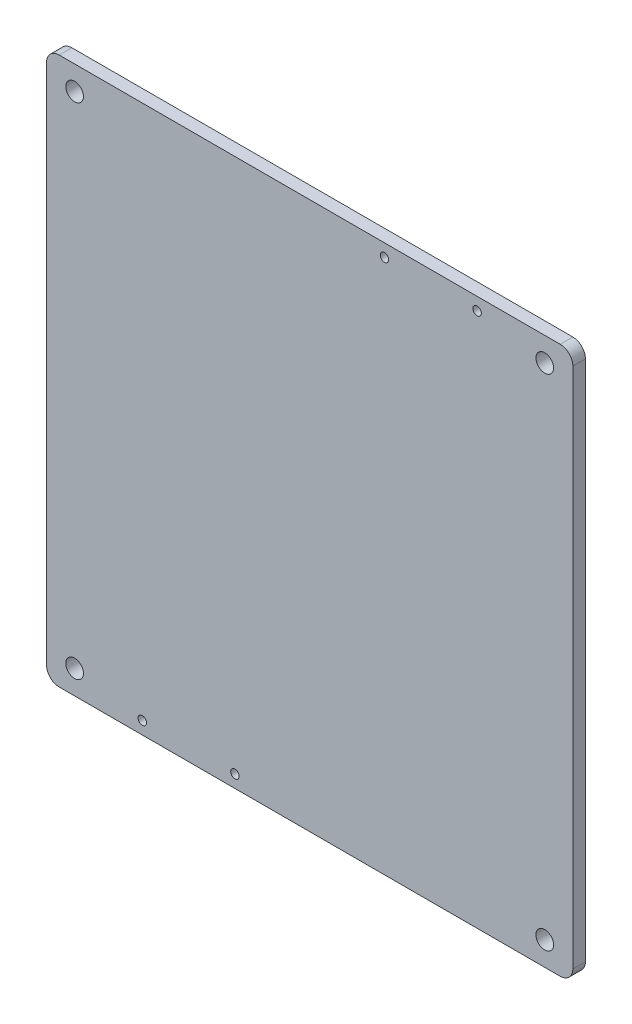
ISO-10303-21;
HEADER;
FILE_DESCRIPTION(('STEP AP214'),'2;1');
FILE_NAME('part.step','',(''),(''),'','','');
FILE_SCHEMA(('AUTOMOTIVE_DESIGN { 1 0 10303 214 1 1 1 1 }'));
ENDSEC;
DATA;
#1=APPLICATION_CONTEXT('core data for automotive mechanical design processes');
#2=APPLICATION_PROTOCOL_DEFINITION('international standard','automotive_design',2000,#1);
#3=PRODUCT_CONTEXT('',#1,'mechanical');
#4=PRODUCT('Part','Part','',(#3));
#5=PRODUCT_RELATED_PRODUCT_CATEGORY('part','',(#4));
#6=PRODUCT_DEFINITION_FORMATION('','',#4);
#7=PRODUCT_DEFINITION_CONTEXT('part definition',#1,'design');
#8=PRODUCT_DEFINITION('design','',#6,#7);
#9=PRODUCT_DEFINITION_SHAPE('','',#8);
#10=(LENGTH_UNIT() NAMED_UNIT(*) SI_UNIT(.MILLI.,.METRE.));
#11=(NAMED_UNIT(*) PLANE_ANGLE_UNIT() SI_UNIT($,.RADIAN.));
#12=(NAMED_UNIT(*) SI_UNIT($,.STERADIAN.) SOLID_ANGLE_UNIT());
#13=UNCERTAINTY_MEASURE_WITH_UNIT(LENGTH_MEASURE(1.E-05),#10,'distance_accuracy_value','');
#14=(GEOMETRIC_REPRESENTATION_CONTEXT(3) GLOBAL_UNCERTAINTY_ASSIGNED_CONTEXT((#13)) GLOBAL_UNIT_ASSIGNED_CONTEXT((#10,
#11,#12)) REPRESENTATION_CONTEXT('',''));
#15=CARTESIAN_POINT('',(0.,0.,0.));
#16=DIRECTION('',(0.,0.,1.));
#17=DIRECTION('',(1.,0.,0.));
#18=AXIS2_PLACEMENT_3D('',#15,#16,#17);
#19=CARTESIAN_POINT('',(62.5,-65.,3.));
#20=DIRECTION('',(-1.,0.,0.));
#21=DIRECTION('',(0.,0.,1.));
#22=AXIS2_PLACEMENT_3D('',#19,#20,#21);
#23=PLANE('',#22);
#24=DIRECTION('',(0.,1.,0.));
#25=VECTOR('',#24,1.);
#26=CARTESIAN_POINT('',(62.5,-65.,3.));
#27=LINE('',#26,#25);
#28=CARTESIAN_POINT('',(62.5,-62.,3.));
#29=VERTEX_POINT('',#28);
#30=CARTESIAN_POINT('',(62.5,62.,3.));
#31=VERTEX_POINT('',#30);
#32=EDGE_CURVE('E122',#29,#31,#27,.T.);
#33=ORIENTED_EDGE('',*,*,#32,.F.);
#34=DIRECTION('',(0.,0.,-1.));
#35=VECTOR('',#34,1.);
#36=CARTESIAN_POINT('',(62.5,-62.,3.));
#37=LINE('',#36,#35);
#38=CARTESIAN_POINT('',(62.5,-62.,0.));
#39=VERTEX_POINT('',#38);
#40=EDGE_CURVE('E107',#29,#39,#37,.T.);
#41=ORIENTED_EDGE('',*,*,#40,.T.);
#42=DIRECTION('',(0.,1.,0.));
#43=VECTOR('',#42,1.);
#44=CARTESIAN_POINT('',(62.5,-65.,0.));
#45=LINE('',#44,#43);
#46=CARTESIAN_POINT('',(62.5,62.,0.));
#47=VERTEX_POINT('',#46);
#48=EDGE_CURVE('E119',#39,#47,#45,.T.);
#49=ORIENTED_EDGE('',*,*,#48,.T.);
#50=DIRECTION('',(0.,0.,-1.));
#51=VECTOR('',#50,1.);
#52=CARTESIAN_POINT('',(62.5,62.,3.));
#53=LINE('',#52,#51);
#54=EDGE_CURVE('E124',#47,#31,#53,.F.);
#55=ORIENTED_EDGE('',*,*,#54,.T.);
#56=EDGE_LOOP('',(#33,#41,#49,#55));
#57=FACE_BOUND('',#56,.T.);
#58=ADVANCED_FACE('F37',(#57),#23,.F.);
#59=CARTESIAN_POINT('',(-62.5,65.,3.));
#60=DIRECTION('',(0.,-1.,0.));
#61=DIRECTION('',(0.,0.,-1.));
#62=AXIS2_PLACEMENT_3D('',#59,#60,#61);
#63=PLANE('',#62);
#64=DIRECTION('',(-1.,0.,0.));
#65=VECTOR('',#64,1.);
#66=CARTESIAN_POINT('',(-62.5,65.,0.));
#67=LINE('',#66,#65);
#68=CARTESIAN_POINT('',(59.5,65.,0.));
#69=VERTEX_POINT('',#68);
#70=CARTESIAN_POINT('',(-59.5,65.,0.));
#71=VERTEX_POINT('',#70);
#72=EDGE_CURVE('E128',#69,#71,#67,.T.);
#73=ORIENTED_EDGE('',*,*,#72,.T.);
#74=DIRECTION('',(0.,0.,-1.));
#75=VECTOR('',#74,1.);
#76=CARTESIAN_POINT('',(-59.5,65.,3.));
#77=LINE('',#76,#75);
#78=CARTESIAN_POINT('',(-59.5,65.,3.));
#79=VERTEX_POINT('',#78);
#80=EDGE_CURVE('E11',#71,#79,#77,.F.);
#81=ORIENTED_EDGE('',*,*,#80,.T.);
#82=DIRECTION('',(-1.,0.,0.));
#83=VECTOR('',#82,1.);
#84=CARTESIAN_POINT('',(-62.5,65.,3.));
#85=LINE('',#84,#83);
#86=CARTESIAN_POINT('',(59.5,65.,3.));
#87=VERTEX_POINT('',#86);
#88=EDGE_CURVE('E168',#87,#79,#85,.T.);
#89=ORIENTED_EDGE('',*,*,#88,.F.);
#90=DIRECTION('',(0.,0.,-1.));
#91=VECTOR('',#90,1.);
#92=CARTESIAN_POINT('',(59.5,65.,3.));
#93=LINE('',#92,#91);
#94=EDGE_CURVE('E45',#87,#69,#93,.T.);
#95=ORIENTED_EDGE('',*,*,#94,.T.);
#96=EDGE_LOOP('',(#73,#81,#89,#95));
#97=FACE_BOUND('',#96,.T.);
#98=ADVANCED_FACE('F166',(#97),#63,.F.);
#99=CARTESIAN_POINT('',(-62.5,-65.,3.));
#100=DIRECTION('',(1.,0.,0.));
#101=DIRECTION('',(0.,0.,-1.));
#102=AXIS2_PLACEMENT_3D('',#99,#100,#101);
#103=PLANE('',#102);
#104=DIRECTION('',(0.,-1.,0.));
#105=VECTOR('',#104,1.);
#106=CARTESIAN_POINT('',(-62.5,-65.,0.));
#107=LINE('',#106,#105);
#108=CARTESIAN_POINT('',(-62.5,62.,0.));
#109=VERTEX_POINT('',#108);
#110=CARTESIAN_POINT('',(-62.5,-62.,0.));
#111=VERTEX_POINT('',#110);
#112=EDGE_CURVE('E132',#109,#111,#107,.T.);
#113=ORIENTED_EDGE('',*,*,#112,.T.);
#114=DIRECTION('',(0.,0.,-1.));
#115=VECTOR('',#114,1.);
#116=CARTESIAN_POINT('',(-62.5,-62.,3.));
#117=LINE('',#116,#115);
#118=CARTESIAN_POINT('',(-62.5,-62.,3.));
#119=VERTEX_POINT('',#118);
#120=EDGE_CURVE('E52',#111,#119,#117,.F.);
#121=ORIENTED_EDGE('',*,*,#120,.T.);
#122=DIRECTION('',(0.,-1.,0.));
#123=VECTOR('',#122,1.);
#124=CARTESIAN_POINT('',(-62.5,-65.,3.));
#125=LINE('',#124,#123);
#126=CARTESIAN_POINT('',(-62.5,62.,3.));
#127=VERTEX_POINT('',#126);
#128=EDGE_CURVE('E176',#127,#119,#125,.T.);
#129=ORIENTED_EDGE('',*,*,#128,.F.);
#130=DIRECTION('',(0.,0.,-1.));
#131=VECTOR('',#130,1.);
#132=CARTESIAN_POINT('',(-62.5,62.,3.));
#133=LINE('',#132,#131);
#134=EDGE_CURVE('E159',#127,#109,#133,.T.);
#135=ORIENTED_EDGE('',*,*,#134,.T.);
#136=EDGE_LOOP('',(#113,#121,#129,#135));
#137=FACE_BOUND('',#136,.T.);
#138=ADVANCED_FACE('F175',(#137),#103,.F.);
#139=CARTESIAN_POINT('',(-62.5,-65.,3.));
#140=DIRECTION('',(0.,1.,0.));
#141=DIRECTION('',(0.,0.,1.));
#142=AXIS2_PLACEMENT_3D('',#139,#140,#141);
#143=PLANE('',#142);
#144=DIRECTION('',(1.,0.,0.));
#145=VECTOR('',#144,1.);
#146=CARTESIAN_POINT('',(-62.5,-65.,0.));
#147=LINE('',#146,#145);
#148=CARTESIAN_POINT('',(-59.5,-65.,0.));
#149=VERTEX_POINT('',#148);
#150=CARTESIAN_POINT('',(59.5,-65.,0.));
#151=VERTEX_POINT('',#150);
#152=EDGE_CURVE('E142',#149,#151,#147,.T.);
#153=ORIENTED_EDGE('',*,*,#152,.T.);
#154=DIRECTION('',(0.,0.,-1.));
#155=VECTOR('',#154,1.);
#156=CARTESIAN_POINT('',(59.5,-65.,3.));
#157=LINE('',#156,#155);
#158=CARTESIAN_POINT('',(59.5,-65.,3.));
#159=VERTEX_POINT('',#158);
#160=EDGE_CURVE('E108',#151,#159,#157,.F.);
#161=ORIENTED_EDGE('',*,*,#160,.T.);
#162=DIRECTION('',(1.,0.,0.));
#163=VECTOR('',#162,1.);
#164=CARTESIAN_POINT('',(-62.5,-65.,3.));
#165=LINE('',#164,#163);
#166=CARTESIAN_POINT('',(-59.5,-65.,3.));
#167=VERTEX_POINT('',#166);
#168=EDGE_CURVE('E138',#167,#159,#165,.T.);
#169=ORIENTED_EDGE('',*,*,#168,.F.);
#170=DIRECTION('',(0.,0.,-1.));
#171=VECTOR('',#170,1.);
#172=CARTESIAN_POINT('',(-59.5,-65.,3.));
#173=LINE('',#172,#171);
#174=EDGE_CURVE('E113',#167,#149,#173,.T.);
#175=ORIENTED_EDGE('',*,*,#174,.T.);
#176=EDGE_LOOP('',(#153,#161,#169,#175));
#177=FACE_BOUND('',#176,.T.);
#178=ADVANCED_FACE('F326',(#177),#143,.F.);
#179=CARTESIAN_POINT('',(0.,0.,3.));
#180=DIRECTION('',(0.,0.,-1.));
#181=DIRECTION('',(-1.,0.,0.));
#182=AXIS2_PLACEMENT_3D('',#179,#180,#181);
#183=PLANE('',#182);
#184=CARTESIAN_POINT('',(39.76,62.,3.));
#185=DIRECTION('',(0.,0.,-1.));
#186=DIRECTION('',(-1.,0.,0.));
#187=AXIS2_PLACEMENT_3D('',#184,#185,#186);
#188=CIRCLE('',#187,0.999999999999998);
#189=CARTESIAN_POINT('',(38.76,62.,3.));
#190=VERTEX_POINT('',#189);
#191=EDGE_CURVE('E202',#190,#190,#188,.F.);
#192=ORIENTED_EDGE('',*,*,#191,.F.);
#193=EDGE_LOOP('',(#192));
#194=FACE_BOUND('',#193,.T.);
#195=CARTESIAN_POINT('',(-17.76,-62.,3.));
#196=DIRECTION('',(0.,0.,-1.));
#197=DIRECTION('',(-1.,0.,0.));
#198=AXIS2_PLACEMENT_3D('',#195,#196,#197);
#199=CIRCLE('',#198,1.);
#200=CARTESIAN_POINT('',(-18.76,-62.,3.));
#201=VERTEX_POINT('',#200);
#202=EDGE_CURVE('E219',#201,#201,#199,.F.);
#203=ORIENTED_EDGE('',*,*,#202,.F.);
#204=EDGE_LOOP('',(#203));
#205=FACE_BOUND('',#204,.T.);
#206=CARTESIAN_POINT('',(-39.76,-62.,3.));
#207=DIRECTION('',(0.,0.,-1.));
#208=DIRECTION('',(-1.,0.,0.));
#209=AXIS2_PLACEMENT_3D('',#206,#207,#208);
#210=CIRCLE('',#209,0.999999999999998);
#211=CARTESIAN_POINT('',(-40.76,-62.,3.));
#212=VERTEX_POINT('',#211);
#213=EDGE_CURVE('E207',#212,#212,#210,.F.);
#214=ORIENTED_EDGE('',*,*,#213,.F.);
#215=EDGE_LOOP('',(#214));
#216=FACE_BOUND('',#215,.T.);
#217=CARTESIAN_POINT('',(17.76,62.,3.));
#218=DIRECTION('',(0.,0.,-1.));
#219=DIRECTION('',(-1.,0.,0.));
#220=AXIS2_PLACEMENT_3D('',#217,#218,#219);
#221=CIRCLE('',#220,1.);
#222=CARTESIAN_POINT('',(16.76,62.,3.));
#223=VERTEX_POINT('',#222);
#224=EDGE_CURVE('E206',#223,#223,#221,.F.);
#225=ORIENTED_EDGE('',*,*,#224,.F.);
#226=EDGE_LOOP('',(#225));
#227=FACE_BOUND('',#226,.T.);
#228=CARTESIAN_POINT('',(-55.835,59.325,3.));
#229=DIRECTION('',(0.,0.,-1.));
#230=DIRECTION('',(-1.,0.,0.));
#231=AXIS2_PLACEMENT_3D('',#228,#229,#230);
#232=CIRCLE('',#231,2.1);
#233=CARTESIAN_POINT('',(-57.935,59.325,3.));
#234=VERTEX_POINT('',#233);
#235=EDGE_CURVE('E188',#234,#234,#232,.F.);
#236=ORIENTED_EDGE('',*,*,#235,.F.);
#237=EDGE_LOOP('',(#236));
#238=FACE_BOUND('',#237,.T.);
#239=CARTESIAN_POINT('',(55.835,-59.325,3.));
#240=DIRECTION('',(0.,0.,-1.));
#241=DIRECTION('',(-1.,0.,0.));
#242=AXIS2_PLACEMENT_3D('',#239,#240,#241);
#243=CIRCLE('',#242,2.1);
#244=CARTESIAN_POINT('',(53.735,-59.325,3.));
#245=VERTEX_POINT('',#244);
#246=EDGE_CURVE('E189',#245,#245,#243,.F.);
#247=ORIENTED_EDGE('',*,*,#246,.F.);
#248=EDGE_LOOP('',(#247));
#249=FACE_BOUND('',#248,.T.);
#250=CARTESIAN_POINT('',(-55.835,-59.325,3.));
#251=DIRECTION('',(0.,0.,-1.));
#252=DIRECTION('',(-1.,0.,0.));
#253=AXIS2_PLACEMENT_3D('',#250,#251,#252);
#254=CIRCLE('',#253,2.1);
#255=CARTESIAN_POINT('',(-57.935,-59.325,3.));
#256=VERTEX_POINT('',#255);
#257=EDGE_CURVE('E199',#256,#256,#254,.F.);
#258=ORIENTED_EDGE('',*,*,#257,.F.);
#259=EDGE_LOOP('',(#258));
#260=FACE_BOUND('',#259,.T.);
#261=CARTESIAN_POINT('',(55.835,59.325,3.));
#262=DIRECTION('',(0.,0.,-1.));
#263=DIRECTION('',(-1.,0.,0.));
#264=AXIS2_PLACEMENT_3D('',#261,#262,#263);
#265=CIRCLE('',#264,2.1);
#266=CARTESIAN_POINT('',(53.735,59.325,3.));
#267=VERTEX_POINT('',#266);
#268=EDGE_CURVE('E129',#267,#267,#265,.F.);
#269=ORIENTED_EDGE('',*,*,#268,.F.);
#270=EDGE_LOOP('',(#269));
#271=FACE_BOUND('',#270,.T.);
#272=ORIENTED_EDGE('',*,*,#168,.T.);
#273=CARTESIAN_POINT('',(59.5,-62.,3.));
#274=DIRECTION('',(0.,0.,-1.));
#275=DIRECTION('',(-1.,0.,0.));
#276=AXIS2_PLACEMENT_3D('',#273,#274,#275);
#277=CIRCLE('',#276,3.);
#278=EDGE_CURVE('E157',#159,#29,#277,.F.);
#279=ORIENTED_EDGE('',*,*,#278,.T.);
#280=ORIENTED_EDGE('',*,*,#32,.T.);
#281=CARTESIAN_POINT('',(59.5,62.,3.));
#282=DIRECTION('',(0.,0.,-1.));
#283=DIRECTION('',(-1.,0.,0.));
#284=AXIS2_PLACEMENT_3D('',#281,#282,#283);
#285=CIRCLE('',#284,3.);
#286=EDGE_CURVE('E152',#31,#87,#285,.F.);
#287=ORIENTED_EDGE('',*,*,#286,.T.);
#288=ORIENTED_EDGE('',*,*,#88,.T.);
#289=CARTESIAN_POINT('',(-59.5,62.,3.));
#290=DIRECTION('',(0.,0.,-1.));
#291=DIRECTION('',(-1.,0.,0.));
#292=AXIS2_PLACEMENT_3D('',#289,#290,#291);
#293=CIRCLE('',#292,3.);
#294=EDGE_CURVE('E59',#79,#127,#293,.F.);
#295=ORIENTED_EDGE('',*,*,#294,.T.);
#296=ORIENTED_EDGE('',*,*,#128,.T.);
#297=CARTESIAN_POINT('',(-59.5,-62.,3.));
#298=DIRECTION('',(0.,0.,-1.));
#299=DIRECTION('',(-1.,0.,0.));
#300=AXIS2_PLACEMENT_3D('',#297,#298,#299);
#301=CIRCLE('',#300,3.);
#302=EDGE_CURVE('E155',#119,#167,#301,.F.);
#303=ORIENTED_EDGE('',*,*,#302,.T.);
#304=EDGE_LOOP('',(#272,#279,#280,#287,#288,#295,#296,#303));
#305=FACE_BOUND('',#304,.T.);
#306=ADVANCED_FACE('F231',(#194,#205,#216,#227,#238,#249,#260,#271,#305),#183,.F.);
#307=CARTESIAN_POINT('',(0.,0.,0.));
#308=DIRECTION('',(0.,0.,-1.));
#309=DIRECTION('',(-1.,0.,0.));
#310=AXIS2_PLACEMENT_3D('',#307,#308,#309);
#311=PLANE('',#310);
#312=CARTESIAN_POINT('',(39.76,62.,0.));
#313=DIRECTION('',(0.,0.,-1.));
#314=DIRECTION('',(-1.,0.,0.));
#315=AXIS2_PLACEMENT_3D('',#312,#313,#314);
#316=CIRCLE('',#315,0.999999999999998);
#317=CARTESIAN_POINT('',(38.76,62.,0.));
#318=VERTEX_POINT('',#317);
#319=EDGE_CURVE('E214',#318,#318,#316,.T.);
#320=ORIENTED_EDGE('',*,*,#319,.F.);
#321=EDGE_LOOP('',(#320));
#322=FACE_BOUND('',#321,.T.);
#323=CARTESIAN_POINT('',(-17.76,-62.,0.));
#324=DIRECTION('',(0.,0.,-1.));
#325=DIRECTION('',(-1.,0.,0.));
#326=AXIS2_PLACEMENT_3D('',#323,#324,#325);
#327=CIRCLE('',#326,1.);
#328=CARTESIAN_POINT('',(-18.76,-62.,0.));
#329=VERTEX_POINT('',#328);
#330=EDGE_CURVE('E210',#329,#329,#327,.T.);
#331=ORIENTED_EDGE('',*,*,#330,.F.);
#332=EDGE_LOOP('',(#331));
#333=FACE_BOUND('',#332,.T.);
#334=CARTESIAN_POINT('',(-39.76,-62.,0.));
#335=DIRECTION('',(0.,0.,-1.));
#336=DIRECTION('',(-1.,0.,0.));
#337=AXIS2_PLACEMENT_3D('',#334,#335,#336);
#338=CIRCLE('',#337,0.999999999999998);
#339=CARTESIAN_POINT('',(-40.76,-62.,0.));
#340=VERTEX_POINT('',#339);
#341=EDGE_CURVE('E203',#340,#340,#338,.T.);
#342=ORIENTED_EDGE('',*,*,#341,.F.);
#343=EDGE_LOOP('',(#342));
#344=FACE_BOUND('',#343,.T.);
#345=CARTESIAN_POINT('',(17.76,62.,0.));
#346=DIRECTION('',(0.,0.,-1.));
#347=DIRECTION('',(-1.,0.,0.));
#348=AXIS2_PLACEMENT_3D('',#345,#346,#347);
#349=CIRCLE('',#348,1.);
#350=CARTESIAN_POINT('',(16.76,62.,0.));
#351=VERTEX_POINT('',#350);
#352=EDGE_CURVE('E211',#351,#351,#349,.T.);
#353=ORIENTED_EDGE('',*,*,#352,.F.);
#354=EDGE_LOOP('',(#353));
#355=FACE_BOUND('',#354,.T.);
#356=CARTESIAN_POINT('',(-55.835,59.325,0.));
#357=DIRECTION('',(0.,0.,-1.));
#358=DIRECTION('',(-1.,0.,0.));
#359=AXIS2_PLACEMENT_3D('',#356,#357,#358);
#360=CIRCLE('',#359,2.1);
#361=CARTESIAN_POINT('',(-57.935,59.325,0.));
#362=VERTEX_POINT('',#361);
#363=EDGE_CURVE('E184',#362,#362,#360,.T.);
#364=ORIENTED_EDGE('',*,*,#363,.F.);
#365=EDGE_LOOP('',(#364));
#366=FACE_BOUND('',#365,.T.);
#367=CARTESIAN_POINT('',(55.835,-59.325,0.));
#368=DIRECTION('',(0.,0.,-1.));
#369=DIRECTION('',(-1.,0.,0.));
#370=AXIS2_PLACEMENT_3D('',#367,#368,#369);
#371=CIRCLE('',#370,2.1);
#372=CARTESIAN_POINT('',(53.735,-59.325,0.));
#373=VERTEX_POINT('',#372);
#374=EDGE_CURVE('E185',#373,#373,#371,.T.);
#375=ORIENTED_EDGE('',*,*,#374,.F.);
#376=EDGE_LOOP('',(#375));
#377=FACE_BOUND('',#376,.T.);
#378=CARTESIAN_POINT('',(-55.835,-59.325,0.));
#379=DIRECTION('',(0.,0.,-1.));
#380=DIRECTION('',(-1.,0.,0.));
#381=AXIS2_PLACEMENT_3D('',#378,#379,#380);
#382=CIRCLE('',#381,2.1);
#383=CARTESIAN_POINT('',(-57.935,-59.325,0.));
#384=VERTEX_POINT('',#383);
#385=EDGE_CURVE('E192',#384,#384,#382,.T.);
#386=ORIENTED_EDGE('',*,*,#385,.F.);
#387=EDGE_LOOP('',(#386));
#388=FACE_BOUND('',#387,.T.);
#389=CARTESIAN_POINT('',(55.835,59.325,0.));
#390=DIRECTION('',(0.,0.,-1.));
#391=DIRECTION('',(-1.,0.,0.));
#392=AXIS2_PLACEMENT_3D('',#389,#390,#391);
#393=CIRCLE('',#392,2.1);
#394=CARTESIAN_POINT('',(53.735,59.325,0.));
#395=VERTEX_POINT('',#394);
#396=EDGE_CURVE('E135',#395,#395,#393,.T.);
#397=ORIENTED_EDGE('',*,*,#396,.F.);
#398=EDGE_LOOP('',(#397));
#399=FACE_BOUND('',#398,.T.);
#400=ORIENTED_EDGE('',*,*,#48,.F.);
#401=CARTESIAN_POINT('',(59.5,-62.,0.));
#402=DIRECTION('',(0.,0.,-1.));
#403=DIRECTION('',(-1.,0.,0.));
#404=AXIS2_PLACEMENT_3D('',#401,#402,#403);
#405=CIRCLE('',#404,3.);
#406=EDGE_CURVE('E103',#39,#151,#405,.T.);
#407=ORIENTED_EDGE('',*,*,#406,.T.);
#408=ORIENTED_EDGE('',*,*,#152,.F.);
#409=CARTESIAN_POINT('',(-59.5,-62.,0.));
#410=DIRECTION('',(0.,0.,-1.));
#411=DIRECTION('',(-1.,0.,0.));
#412=AXIS2_PLACEMENT_3D('',#409,#410,#411);
#413=CIRCLE('',#412,3.);
#414=EDGE_CURVE('E114',#149,#111,#413,.T.);
#415=ORIENTED_EDGE('',*,*,#414,.T.);
#416=ORIENTED_EDGE('',*,*,#112,.F.);
#417=CARTESIAN_POINT('',(-59.5,62.,0.));
#418=DIRECTION('',(0.,0.,-1.));
#419=DIRECTION('',(-1.,0.,0.));
#420=AXIS2_PLACEMENT_3D('',#417,#418,#419);
#421=CIRCLE('',#420,3.);
#422=EDGE_CURVE('E146',#109,#71,#421,.T.);
#423=ORIENTED_EDGE('',*,*,#422,.T.);
#424=ORIENTED_EDGE('',*,*,#72,.F.);
#425=CARTESIAN_POINT('',(59.5,62.,0.));
#426=DIRECTION('',(0.,0.,-1.));
#427=DIRECTION('',(-1.,0.,0.));
#428=AXIS2_PLACEMENT_3D('',#425,#426,#427);
#429=CIRCLE('',#428,3.);
#430=EDGE_CURVE('E123',#69,#47,#429,.T.);
#431=ORIENTED_EDGE('',*,*,#430,.T.);
#432=EDGE_LOOP('',(#400,#407,#408,#415,#416,#423,#424,#431));
#433=FACE_BOUND('',#432,.T.);
#434=ADVANCED_FACE('F126',(#322,#333,#344,#355,#366,#377,#388,#399,#433),#311,.T.);
#435=CARTESIAN_POINT('',(59.5,-62.,3.));
#436=DIRECTION('',(0.,0.,-1.));
#437=DIRECTION('',(-1.,0.,0.));
#438=AXIS2_PLACEMENT_3D('',#435,#436,#437);
#439=CYLINDRICAL_SURFACE('',#438,3.);
#440=ORIENTED_EDGE('',*,*,#278,.F.);
#441=ORIENTED_EDGE('',*,*,#160,.F.);
#442=ORIENTED_EDGE('',*,*,#406,.F.);
#443=ORIENTED_EDGE('',*,*,#40,.F.);
#444=EDGE_LOOP('',(#440,#441,#442,#443));
#445=FACE_BOUND('',#444,.T.);
#446=ADVANCED_FACE('F106',(#445),#439,.T.);
#447=CARTESIAN_POINT('',(-59.5,-62.,3.));
#448=DIRECTION('',(0.,0.,-1.));
#449=DIRECTION('',(-1.,0.,0.));
#450=AXIS2_PLACEMENT_3D('',#447,#448,#449);
#451=CYLINDRICAL_SURFACE('',#450,3.);
#452=ORIENTED_EDGE('',*,*,#302,.F.);
#453=ORIENTED_EDGE('',*,*,#120,.F.);
#454=ORIENTED_EDGE('',*,*,#414,.F.);
#455=ORIENTED_EDGE('',*,*,#174,.F.);
#456=EDGE_LOOP('',(#452,#453,#454,#455));
#457=FACE_BOUND('',#456,.T.);
#458=ADVANCED_FACE('F271',(#457),#451,.T.);
#459=CARTESIAN_POINT('',(-59.5,62.,3.));
#460=DIRECTION('',(0.,0.,-1.));
#461=DIRECTION('',(-1.,0.,0.));
#462=AXIS2_PLACEMENT_3D('',#459,#460,#461);
#463=CYLINDRICAL_SURFACE('',#462,3.);
#464=ORIENTED_EDGE('',*,*,#294,.F.);
#465=ORIENTED_EDGE('',*,*,#80,.F.);
#466=ORIENTED_EDGE('',*,*,#422,.F.);
#467=ORIENTED_EDGE('',*,*,#134,.F.);
#468=EDGE_LOOP('',(#464,#465,#466,#467));
#469=FACE_BOUND('',#468,.T.);
#470=ADVANCED_FACE('F174',(#469),#463,.T.);
#471=CARTESIAN_POINT('',(59.5,62.,3.));
#472=DIRECTION('',(0.,0.,-1.));
#473=DIRECTION('',(-1.,0.,0.));
#474=AXIS2_PLACEMENT_3D('',#471,#472,#473);
#475=CYLINDRICAL_SURFACE('',#474,3.);
#476=ORIENTED_EDGE('',*,*,#286,.F.);
#477=ORIENTED_EDGE('',*,*,#54,.F.);
#478=ORIENTED_EDGE('',*,*,#430,.F.);
#479=ORIENTED_EDGE('',*,*,#94,.F.);
#480=EDGE_LOOP('',(#476,#477,#478,#479));
#481=FACE_BOUND('',#480,.T.);
#482=ADVANCED_FACE('F39',(#481),#475,.T.);
#483=CARTESIAN_POINT('',(55.835,59.325,8.93969696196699));
#484=DIRECTION('',(0.,0.,-1.));
#485=DIRECTION('',(-1.,0.,0.));
#486=AXIS2_PLACEMENT_3D('',#483,#484,#485);
#487=CYLINDRICAL_SURFACE('',#486,2.1);
#488=ORIENTED_EDGE('',*,*,#268,.T.);
#489=EDGE_LOOP('',(#488));
#490=FACE_BOUND('',#489,.T.);
#491=ORIENTED_EDGE('',*,*,#396,.T.);
#492=EDGE_LOOP('',(#491));
#493=FACE_BOUND('',#492,.T.);
#494=ADVANCED_FACE('F247',(#490,#493),#487,.F.);
#495=CARTESIAN_POINT('',(-55.835,-59.325,8.93969696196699));
#496=DIRECTION('',(0.,0.,-1.));
#497=DIRECTION('',(-1.,0.,0.));
#498=AXIS2_PLACEMENT_3D('',#495,#496,#497);
#499=CYLINDRICAL_SURFACE('',#498,2.1);
#500=ORIENTED_EDGE('',*,*,#257,.T.);
#501=EDGE_LOOP('',(#500));
#502=FACE_BOUND('',#501,.T.);
#503=ORIENTED_EDGE('',*,*,#385,.T.);
#504=EDGE_LOOP('',(#503));
#505=FACE_BOUND('',#504,.T.);
#506=ADVANCED_FACE('F249',(#502,#505),#499,.F.);
#507=CARTESIAN_POINT('',(55.835,-59.325,8.93969696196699));
#508=DIRECTION('',(0.,0.,-1.));
#509=DIRECTION('',(-1.,0.,0.));
#510=AXIS2_PLACEMENT_3D('',#507,#508,#509);
#511=CYLINDRICAL_SURFACE('',#510,2.1);
#512=ORIENTED_EDGE('',*,*,#246,.T.);
#513=EDGE_LOOP('',(#512));
#514=FACE_BOUND('',#513,.T.);
#515=ORIENTED_EDGE('',*,*,#374,.T.);
#516=EDGE_LOOP('',(#515));
#517=FACE_BOUND('',#516,.T.);
#518=ADVANCED_FACE('F256',(#514,#517),#511,.F.);
#519=CARTESIAN_POINT('',(-55.835,59.325,8.93969696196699));
#520=DIRECTION('',(0.,0.,-1.));
#521=DIRECTION('',(-1.,0.,0.));
#522=AXIS2_PLACEMENT_3D('',#519,#520,#521);
#523=CYLINDRICAL_SURFACE('',#522,2.1);
#524=ORIENTED_EDGE('',*,*,#235,.T.);
#525=EDGE_LOOP('',(#524));
#526=FACE_BOUND('',#525,.T.);
#527=ORIENTED_EDGE('',*,*,#363,.T.);
#528=EDGE_LOOP('',(#527));
#529=FACE_BOUND('',#528,.T.);
#530=ADVANCED_FACE('F305',(#526,#529),#523,.F.);
#531=CARTESIAN_POINT('',(17.76,62.,5.82842712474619));
#532=DIRECTION('',(0.,0.,-1.));
#533=DIRECTION('',(-1.,0.,0.));
#534=AXIS2_PLACEMENT_3D('',#531,#532,#533);
#535=CYLINDRICAL_SURFACE('',#534,1.);
#536=CARTESIAN_POINT('',(16.76,62.,3.));
#537=CARTESIAN_POINT('',(16.76,62.,2.96875));
#538=CARTESIAN_POINT('',(16.76,62.,2.9375));
#539=CARTESIAN_POINT('',(16.76,62.,2.875));
#540=CARTESIAN_POINT('',(16.76,62.,2.84375));
#541=CARTESIAN_POINT('',(16.76,62.,2.78125));
#542=CARTESIAN_POINT('',(16.76,62.,2.75));
#543=CARTESIAN_POINT('',(16.76,62.,2.6875));
#544=CARTESIAN_POINT('',(16.76,62.,2.65625));
#545=CARTESIAN_POINT('',(16.76,62.,2.59375));
#546=CARTESIAN_POINT('',(16.76,62.,2.5625));
#547=CARTESIAN_POINT('',(16.76,62.,2.5));
#548=CARTESIAN_POINT('',(16.76,62.,2.46875));
#549=CARTESIAN_POINT('',(16.76,62.,2.40625));
#550=CARTESIAN_POINT('',(16.76,62.,2.375));
#551=CARTESIAN_POINT('',(16.76,62.,2.3125));
#552=CARTESIAN_POINT('',(16.76,62.,2.28125));
#553=CARTESIAN_POINT('',(16.76,62.,2.21875));
#554=CARTESIAN_POINT('',(16.76,62.,2.1875));
#555=CARTESIAN_POINT('',(16.76,62.,2.125));
#556=CARTESIAN_POINT('',(16.76,62.,2.09375));
#557=CARTESIAN_POINT('',(16.76,62.,2.03125));
#558=CARTESIAN_POINT('',(16.76,62.,2.));
#559=CARTESIAN_POINT('',(16.76,62.,1.9375));
#560=CARTESIAN_POINT('',(16.76,62.,1.90625));
#561=CARTESIAN_POINT('',(16.76,62.,1.84375));
#562=CARTESIAN_POINT('',(16.76,62.,1.8125));
#563=CARTESIAN_POINT('',(16.76,62.,1.75));
#564=CARTESIAN_POINT('',(16.76,62.,1.71875));
#565=CARTESIAN_POINT('',(16.76,62.,1.65625));
#566=CARTESIAN_POINT('',(16.76,62.,1.625));
#567=CARTESIAN_POINT('',(16.76,62.,1.5625));
#568=CARTESIAN_POINT('',(16.76,62.,1.53125));
#569=CARTESIAN_POINT('',(16.76,62.,1.46875));
#570=CARTESIAN_POINT('',(16.76,62.,1.4375));
#571=CARTESIAN_POINT('',(16.76,62.,1.375));
#572=CARTESIAN_POINT('',(16.76,62.,1.34375));
#573=CARTESIAN_POINT('',(16.76,62.,1.28125));
#574=CARTESIAN_POINT('',(16.76,62.,1.25));
#575=CARTESIAN_POINT('',(16.76,62.,1.1875));
#576=CARTESIAN_POINT('',(16.76,62.,1.15625));
#577=CARTESIAN_POINT('',(16.76,62.,1.09375));
#578=CARTESIAN_POINT('',(16.76,62.,1.0625));
#579=CARTESIAN_POINT('',(16.76,62.,1.));
#580=CARTESIAN_POINT('',(16.76,62.,0.968750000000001));
#581=CARTESIAN_POINT('',(16.76,62.,0.906250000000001));
#582=CARTESIAN_POINT('',(16.76,62.,0.875000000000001));
#583=CARTESIAN_POINT('',(16.76,62.,0.812500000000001));
#584=CARTESIAN_POINT('',(16.76,62.,0.781250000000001));
#585=CARTESIAN_POINT('',(16.76,62.,0.718750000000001));
#586=CARTESIAN_POINT('',(16.76,62.,0.687500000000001));
#587=CARTESIAN_POINT('',(16.76,62.,0.625000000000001));
#588=CARTESIAN_POINT('',(16.76,62.,0.593750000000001));
#589=CARTESIAN_POINT('',(16.76,62.,0.53125));
#590=CARTESIAN_POINT('',(16.76,62.,0.5));
#591=CARTESIAN_POINT('',(16.76,62.,0.4375));
#592=CARTESIAN_POINT('',(16.76,62.,0.40625));
#593=CARTESIAN_POINT('',(16.76,62.,0.34375));
#594=CARTESIAN_POINT('',(16.76,62.,0.3125));
#595=CARTESIAN_POINT('',(16.76,62.,0.25));
#596=CARTESIAN_POINT('',(16.76,62.,0.21875));
#597=CARTESIAN_POINT('',(16.76,62.,0.15625));
#598=CARTESIAN_POINT('',(16.76,62.,0.125));
#599=CARTESIAN_POINT('',(16.76,62.,0.0625000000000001));
#600=CARTESIAN_POINT('',(16.76,62.,0.03125));
#601=CARTESIAN_POINT('',(16.76,62.,0.));
#602=B_SPLINE_CURVE_WITH_KNOTS('',3,(#536,#537,#538,#539,#540,#541,#542,#543,#544,#545,#546,
#547,#548,#549,#550,#551,#552,#553,#554,#555,#556,#557,#558,#559,#560,#561,#562,#563,#564,#565,
#566,#567,#568,#569,#570,#571,#572,#573,#574,#575,#576,#577,#578,#579,#580,#581,#582,#583,#584,
#585,#586,#587,#588,#589,#590,#591,#592,#593,#594,#595,#596,#597,#598,#599,#600,#601),
.UNSPECIFIED.,.F.,.F.,(4,2,2,2,2,2,2,2,2,2,2,2,2,2,2,2,2,2,2,2,2,2,2,2,2,2,2,2,2,2,2,2,4),(0.,
0.0937500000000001,0.1875,0.28125,0.375,0.46875,0.5625,0.65625,0.75,0.84375,0.9375,1.03125,
1.125,1.21875,1.3125,1.40625,1.5,1.59375,1.6875,1.78125,1.875,1.96875,2.0625,2.15625,2.25,
2.34375,2.4375,2.53125,2.625,2.71875,2.8125,2.90625,3.),.UNSPECIFIED.);
#603=EDGE_CURVE('BSEAM315',#223,#351,#602,.T.);
#604=ORIENTED_EDGE('',*,*,#224,.T.);
#605=ORIENTED_EDGE('',*,*,#352,.T.);
#606=ORIENTED_EDGE('',*,*,#603,.T.);
#607=ORIENTED_EDGE('',*,*,#603,.F.);
#608=EDGE_LOOP('',(#604,#606,#605,#607));
#609=FACE_BOUND('',#608,.T.);
#610=ADVANCED_FACE('F315',(#609),#535,.F.);
#611=CARTESIAN_POINT('',(-39.76,-62.,5.82842712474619));
#612=DIRECTION('',(0.,0.,-1.));
#613=DIRECTION('',(-1.,0.,0.));
#614=AXIS2_PLACEMENT_3D('',#611,#612,#613);
#615=CYLINDRICAL_SURFACE('',#614,0.999999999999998);
#616=CARTESIAN_POINT('',(-40.76,-62.,3.));
#617=CARTESIAN_POINT('',(-40.76,-62.,2.96875));
#618=CARTESIAN_POINT('',(-40.76,-62.,2.9375));
#619=CARTESIAN_POINT('',(-40.76,-62.,2.875));
#620=CARTESIAN_POINT('',(-40.76,-62.,2.84375));
#621=CARTESIAN_POINT('',(-40.76,-62.,2.78125));
#622=CARTESIAN_POINT('',(-40.76,-62.,2.75));
#623=CARTESIAN_POINT('',(-40.76,-62.,2.6875));
#624=CARTESIAN_POINT('',(-40.76,-62.,2.65625));
#625=CARTESIAN_POINT('',(-40.76,-62.,2.59375));
#626=CARTESIAN_POINT('',(-40.76,-62.,2.5625));
#627=CARTESIAN_POINT('',(-40.76,-62.,2.5));
#628=CARTESIAN_POINT('',(-40.76,-62.,2.46875));
#629=CARTESIAN_POINT('',(-40.76,-62.,2.40625));
#630=CARTESIAN_POINT('',(-40.76,-62.,2.375));
#631=CARTESIAN_POINT('',(-40.76,-62.,2.3125));
#632=CARTESIAN_POINT('',(-40.76,-62.,2.28125));
#633=CARTESIAN_POINT('',(-40.76,-62.,2.21875));
#634=CARTESIAN_POINT('',(-40.76,-62.,2.1875));
#635=CARTESIAN_POINT('',(-40.76,-62.,2.125));
#636=CARTESIAN_POINT('',(-40.76,-62.,2.09375));
#637=CARTESIAN_POINT('',(-40.76,-62.,2.03125));
#638=CARTESIAN_POINT('',(-40.76,-62.,2.));
#639=CARTESIAN_POINT('',(-40.76,-62.,1.9375));
#640=CARTESIAN_POINT('',(-40.76,-62.,1.90625));
#641=CARTESIAN_POINT('',(-40.76,-62.,1.84375));
#642=CARTESIAN_POINT('',(-40.76,-62.,1.8125));
#643=CARTESIAN_POINT('',(-40.76,-62.,1.75));
#644=CARTESIAN_POINT('',(-40.76,-62.,1.71875));
#645=CARTESIAN_POINT('',(-40.76,-62.,1.65625));
#646=CARTESIAN_POINT('',(-40.76,-62.,1.625));
#647=CARTESIAN_POINT('',(-40.76,-62.,1.5625));
#648=CARTESIAN_POINT('',(-40.76,-62.,1.53125));
#649=CARTESIAN_POINT('',(-40.76,-62.,1.46875));
#650=CARTESIAN_POINT('',(-40.76,-62.,1.4375));
#651=CARTESIAN_POINT('',(-40.76,-62.,1.375));
#652=CARTESIAN_POINT('',(-40.76,-62.,1.34375));
#653=CARTESIAN_POINT('',(-40.76,-62.,1.28125));
#654=CARTESIAN_POINT('',(-40.76,-62.,1.25));
#655=CARTESIAN_POINT('',(-40.76,-62.,1.1875));
#656=CARTESIAN_POINT('',(-40.76,-62.,1.15625));
#657=CARTESIAN_POINT('',(-40.76,-62.,1.09375));
#658=CARTESIAN_POINT('',(-40.76,-62.,1.0625));
#659=CARTESIAN_POINT('',(-40.76,-62.,1.));
#660=CARTESIAN_POINT('',(-40.76,-62.,0.968750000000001));
#661=CARTESIAN_POINT('',(-40.76,-62.,0.906250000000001));
#662=CARTESIAN_POINT('',(-40.76,-62.,0.875000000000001));
#663=CARTESIAN_POINT('',(-40.76,-62.,0.812500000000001));
#664=CARTESIAN_POINT('',(-40.76,-62.,0.781250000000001));
#665=CARTESIAN_POINT('',(-40.76,-62.,0.718750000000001));
#666=CARTESIAN_POINT('',(-40.76,-62.,0.687500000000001));
#667=CARTESIAN_POINT('',(-40.76,-62.,0.625000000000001));
#668=CARTESIAN_POINT('',(-40.76,-62.,0.593750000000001));
#669=CARTESIAN_POINT('',(-40.76,-62.,0.53125));
#670=CARTESIAN_POINT('',(-40.76,-62.,0.5));
#671=CARTESIAN_POINT('',(-40.76,-62.,0.4375));
#672=CARTESIAN_POINT('',(-40.76,-62.,0.40625));
#673=CARTESIAN_POINT('',(-40.76,-62.,0.34375));
#674=CARTESIAN_POINT('',(-40.76,-62.,0.3125));
#675=CARTESIAN_POINT('',(-40.76,-62.,0.25));
#676=CARTESIAN_POINT('',(-40.76,-62.,0.21875));
#677=CARTESIAN_POINT('',(-40.76,-62.,0.15625));
#678=CARTESIAN_POINT('',(-40.76,-62.,0.125));
#679=CARTESIAN_POINT('',(-40.76,-62.,0.0625000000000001));
#680=CARTESIAN_POINT('',(-40.76,-62.,0.03125));
#681=CARTESIAN_POINT('',(-40.76,-62.,0.));
#682=B_SPLINE_CURVE_WITH_KNOTS('',3,(#616,#617,#618,#619,#620,#621,#622,#623,#624,#625,#626,
#627,#628,#629,#630,#631,#632,#633,#634,#635,#636,#637,#638,#639,#640,#641,#642,#643,#644,#645,
#646,#647,#648,#649,#650,#651,#652,#653,#654,#655,#656,#657,#658,#659,#660,#661,#662,#663,#664,
#665,#666,#667,#668,#669,#670,#671,#672,#673,#674,#675,#676,#677,#678,#679,#680,#681),
.UNSPECIFIED.,.F.,.F.,(4,2,2,2,2,2,2,2,2,2,2,2,2,2,2,2,2,2,2,2,2,2,2,2,2,2,2,2,2,2,2,2,4),(0.,
0.0937500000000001,0.1875,0.28125,0.375,0.46875,0.5625,0.65625,0.75,0.84375,0.9375,1.03125,
1.125,1.21875,1.3125,1.40625,1.5,1.59375,1.6875,1.78125,1.875,1.96875,2.0625,2.15625,2.25,
2.34375,2.4375,2.53125,2.625,2.71875,2.8125,2.90625,3.),.UNSPECIFIED.);
#683=EDGE_CURVE('BSEAM338',#212,#340,#682,.T.);
#684=ORIENTED_EDGE('',*,*,#213,.T.);
#685=ORIENTED_EDGE('',*,*,#341,.T.);
#686=ORIENTED_EDGE('',*,*,#683,.T.);
#687=ORIENTED_EDGE('',*,*,#683,.F.);
#688=EDGE_LOOP('',(#684,#686,#685,#687));
#689=FACE_BOUND('',#688,.T.);
#690=ADVANCED_FACE('F338',(#689),#615,.F.);
#691=CARTESIAN_POINT('',(-17.76,-62.,5.82842712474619));
#692=DIRECTION('',(0.,0.,-1.));
#693=DIRECTION('',(-1.,0.,0.));
#694=AXIS2_PLACEMENT_3D('',#691,#692,#693);
#695=CYLINDRICAL_SURFACE('',#694,1.);
#696=CARTESIAN_POINT('',(-18.76,-62.,3.));
#697=CARTESIAN_POINT('',(-18.76,-62.,2.96875));
#698=CARTESIAN_POINT('',(-18.76,-62.,2.9375));
#699=CARTESIAN_POINT('',(-18.76,-62.,2.875));
#700=CARTESIAN_POINT('',(-18.76,-62.,2.84375));
#701=CARTESIAN_POINT('',(-18.76,-62.,2.78125));
#702=CARTESIAN_POINT('',(-18.76,-62.,2.75));
#703=CARTESIAN_POINT('',(-18.76,-62.,2.6875));
#704=CARTESIAN_POINT('',(-18.76,-62.,2.65625));
#705=CARTESIAN_POINT('',(-18.76,-62.,2.59375));
#706=CARTESIAN_POINT('',(-18.76,-62.,2.5625));
#707=CARTESIAN_POINT('',(-18.76,-62.,2.5));
#708=CARTESIAN_POINT('',(-18.76,-62.,2.46875));
#709=CARTESIAN_POINT('',(-18.76,-62.,2.40625));
#710=CARTESIAN_POINT('',(-18.76,-62.,2.375));
#711=CARTESIAN_POINT('',(-18.76,-62.,2.3125));
#712=CARTESIAN_POINT('',(-18.76,-62.,2.28125));
#713=CARTESIAN_POINT('',(-18.76,-62.,2.21875));
#714=CARTESIAN_POINT('',(-18.76,-62.,2.1875));
#715=CARTESIAN_POINT('',(-18.76,-62.,2.125));
#716=CARTESIAN_POINT('',(-18.76,-62.,2.09375));
#717=CARTESIAN_POINT('',(-18.76,-62.,2.03125));
#718=CARTESIAN_POINT('',(-18.76,-62.,2.));
#719=CARTESIAN_POINT('',(-18.76,-62.,1.9375));
#720=CARTESIAN_POINT('',(-18.76,-62.,1.90625));
#721=CARTESIAN_POINT('',(-18.76,-62.,1.84375));
#722=CARTESIAN_POINT('',(-18.76,-62.,1.8125));
#723=CARTESIAN_POINT('',(-18.76,-62.,1.75));
#724=CARTESIAN_POINT('',(-18.76,-62.,1.71875));
#725=CARTESIAN_POINT('',(-18.76,-62.,1.65625));
#726=CARTESIAN_POINT('',(-18.76,-62.,1.625));
#727=CARTESIAN_POINT('',(-18.76,-62.,1.5625));
#728=CARTESIAN_POINT('',(-18.76,-62.,1.53125));
#729=CARTESIAN_POINT('',(-18.76,-62.,1.46875));
#730=CARTESIAN_POINT('',(-18.76,-62.,1.4375));
#731=CARTESIAN_POINT('',(-18.76,-62.,1.375));
#732=CARTESIAN_POINT('',(-18.76,-62.,1.34375));
#733=CARTESIAN_POINT('',(-18.76,-62.,1.28125));
#734=CARTESIAN_POINT('',(-18.76,-62.,1.25));
#735=CARTESIAN_POINT('',(-18.76,-62.,1.1875));
#736=CARTESIAN_POINT('',(-18.76,-62.,1.15625));
#737=CARTESIAN_POINT('',(-18.76,-62.,1.09375));
#738=CARTESIAN_POINT('',(-18.76,-62.,1.0625));
#739=CARTESIAN_POINT('',(-18.76,-62.,1.));
#740=CARTESIAN_POINT('',(-18.76,-62.,0.968750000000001));
#741=CARTESIAN_POINT('',(-18.76,-62.,0.906250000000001));
#742=CARTESIAN_POINT('',(-18.76,-62.,0.875000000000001));
#743=CARTESIAN_POINT('',(-18.76,-62.,0.812500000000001));
#744=CARTESIAN_POINT('',(-18.76,-62.,0.781250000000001));
#745=CARTESIAN_POINT('',(-18.76,-62.,0.718750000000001));
#746=CARTESIAN_POINT('',(-18.76,-62.,0.687500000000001));
#747=CARTESIAN_POINT('',(-18.76,-62.,0.625000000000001));
#748=CARTESIAN_POINT('',(-18.76,-62.,0.593750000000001));
#749=CARTESIAN_POINT('',(-18.76,-62.,0.53125));
#750=CARTESIAN_POINT('',(-18.76,-62.,0.5));
#751=CARTESIAN_POINT('',(-18.76,-62.,0.4375));
#752=CARTESIAN_POINT('',(-18.76,-62.,0.40625));
#753=CARTESIAN_POINT('',(-18.76,-62.,0.34375));
#754=CARTESIAN_POINT('',(-18.76,-62.,0.3125));
#755=CARTESIAN_POINT('',(-18.76,-62.,0.25));
#756=CARTESIAN_POINT('',(-18.76,-62.,0.21875));
#757=CARTESIAN_POINT('',(-18.76,-62.,0.15625));
#758=CARTESIAN_POINT('',(-18.76,-62.,0.125));
#759=CARTESIAN_POINT('',(-18.76,-62.,0.0625000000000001));
#760=CARTESIAN_POINT('',(-18.76,-62.,0.03125));
#761=CARTESIAN_POINT('',(-18.76,-62.,0.));
#762=B_SPLINE_CURVE_WITH_KNOTS('',3,(#696,#697,#698,#699,#700,#701,#702,#703,#704,#705,#706,
#707,#708,#709,#710,#711,#712,#713,#714,#715,#716,#717,#718,#719,#720,#721,#722,#723,#724,#725,
#726,#727,#728,#729,#730,#731,#732,#733,#734,#735,#736,#737,#738,#739,#740,#741,#742,#743,#744,
#745,#746,#747,#748,#749,#750,#751,#752,#753,#754,#755,#756,#757,#758,#759,#760,#761),
.UNSPECIFIED.,.F.,.F.,(4,2,2,2,2,2,2,2,2,2,2,2,2,2,2,2,2,2,2,2,2,2,2,2,2,2,2,2,2,2,2,2,4),(0.,
0.0937500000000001,0.1875,0.28125,0.375,0.46875,0.5625,0.65625,0.75,0.84375,0.9375,1.03125,
1.125,1.21875,1.3125,1.40625,1.5,1.59375,1.6875,1.78125,1.875,1.96875,2.0625,2.15625,2.25,
2.34375,2.4375,2.53125,2.625,2.71875,2.8125,2.90625,3.),.UNSPECIFIED.);
#763=EDGE_CURVE('BSEAM349',#201,#329,#762,.T.);
#764=ORIENTED_EDGE('',*,*,#202,.T.);
#765=ORIENTED_EDGE('',*,*,#330,.T.);
#766=ORIENTED_EDGE('',*,*,#763,.T.);
#767=ORIENTED_EDGE('',*,*,#763,.F.);
#768=EDGE_LOOP('',(#764,#766,#765,#767));
#769=FACE_BOUND('',#768,.T.);
#770=ADVANCED_FACE('F349',(#769),#695,.F.);
#771=CARTESIAN_POINT('',(39.76,62.,5.82842712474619));
#772=DIRECTION('',(0.,0.,-1.));
#773=DIRECTION('',(-1.,0.,0.));
#774=AXIS2_PLACEMENT_3D('',#771,#772,#773);
#775=CYLINDRICAL_SURFACE('',#774,0.999999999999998);
#776=CARTESIAN_POINT('',(38.76,62.,3.));
#777=CARTESIAN_POINT('',(38.76,62.,2.96875));
#778=CARTESIAN_POINT('',(38.76,62.,2.9375));
#779=CARTESIAN_POINT('',(38.76,62.,2.875));
#780=CARTESIAN_POINT('',(38.76,62.,2.84375));
#781=CARTESIAN_POINT('',(38.76,62.,2.78125));
#782=CARTESIAN_POINT('',(38.76,62.,2.75));
#783=CARTESIAN_POINT('',(38.76,62.,2.6875));
#784=CARTESIAN_POINT('',(38.76,62.,2.65625));
#785=CARTESIAN_POINT('',(38.76,62.,2.59375));
#786=CARTESIAN_POINT('',(38.76,62.,2.5625));
#787=CARTESIAN_POINT('',(38.76,62.,2.5));
#788=CARTESIAN_POINT('',(38.76,62.,2.46875));
#789=CARTESIAN_POINT('',(38.76,62.,2.40625));
#790=CARTESIAN_POINT('',(38.76,62.,2.375));
#791=CARTESIAN_POINT('',(38.76,62.,2.3125));
#792=CARTESIAN_POINT('',(38.76,62.,2.28125));
#793=CARTESIAN_POINT('',(38.76,62.,2.21875));
#794=CARTESIAN_POINT('',(38.76,62.,2.1875));
#795=CARTESIAN_POINT('',(38.76,62.,2.125));
#796=CARTESIAN_POINT('',(38.76,62.,2.09375));
#797=CARTESIAN_POINT('',(38.76,62.,2.03125));
#798=CARTESIAN_POINT('',(38.76,62.,2.));
#799=CARTESIAN_POINT('',(38.76,62.,1.9375));
#800=CARTESIAN_POINT('',(38.76,62.,1.90625));
#801=CARTESIAN_POINT('',(38.76,62.,1.84375));
#802=CARTESIAN_POINT('',(38.76,62.,1.8125));
#803=CARTESIAN_POINT('',(38.76,62.,1.75));
#804=CARTESIAN_POINT('',(38.76,62.,1.71875));
#805=CARTESIAN_POINT('',(38.76,62.,1.65625));
#806=CARTESIAN_POINT('',(38.76,62.,1.625));
#807=CARTESIAN_POINT('',(38.76,62.,1.5625));
#808=CARTESIAN_POINT('',(38.76,62.,1.53125));
#809=CARTESIAN_POINT('',(38.76,62.,1.46875));
#810=CARTESIAN_POINT('',(38.76,62.,1.4375));
#811=CARTESIAN_POINT('',(38.76,62.,1.375));
#812=CARTESIAN_POINT('',(38.76,62.,1.34375));
#813=CARTESIAN_POINT('',(38.76,62.,1.28125));
#814=CARTESIAN_POINT('',(38.76,62.,1.25));
#815=CARTESIAN_POINT('',(38.76,62.,1.1875));
#816=CARTESIAN_POINT('',(38.76,62.,1.15625));
#817=CARTESIAN_POINT('',(38.76,62.,1.09375));
#818=CARTESIAN_POINT('',(38.76,62.,1.0625));
#819=CARTESIAN_POINT('',(38.76,62.,1.));
#820=CARTESIAN_POINT('',(38.76,62.,0.968750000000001));
#821=CARTESIAN_POINT('',(38.76,62.,0.906250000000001));
#822=CARTESIAN_POINT('',(38.76,62.,0.875000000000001));
#823=CARTESIAN_POINT('',(38.76,62.,0.812500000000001));
#824=CARTESIAN_POINT('',(38.76,62.,0.781250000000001));
#825=CARTESIAN_POINT('',(38.76,62.,0.718750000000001));
#826=CARTESIAN_POINT('',(38.76,62.,0.687500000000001));
#827=CARTESIAN_POINT('',(38.76,62.,0.625000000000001));
#828=CARTESIAN_POINT('',(38.76,62.,0.593750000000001));
#829=CARTESIAN_POINT('',(38.76,62.,0.53125));
#830=CARTESIAN_POINT('',(38.76,62.,0.5));
#831=CARTESIAN_POINT('',(38.76,62.,0.4375));
#832=CARTESIAN_POINT('',(38.76,62.,0.40625));
#833=CARTESIAN_POINT('',(38.76,62.,0.34375));
#834=CARTESIAN_POINT('',(38.76,62.,0.3125));
#835=CARTESIAN_POINT('',(38.76,62.,0.25));
#836=CARTESIAN_POINT('',(38.76,62.,0.21875));
#837=CARTESIAN_POINT('',(38.76,62.,0.15625));
#838=CARTESIAN_POINT('',(38.76,62.,0.125));
#839=CARTESIAN_POINT('',(38.76,62.,0.0625000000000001));
#840=CARTESIAN_POINT('',(38.76,62.,0.03125));
#841=CARTESIAN_POINT('',(38.76,62.,0.));
#842=B_SPLINE_CURVE_WITH_KNOTS('',3,(#776,#777,#778,#779,#780,#781,#782,#783,#784,#785,#786,
#787,#788,#789,#790,#791,#792,#793,#794,#795,#796,#797,#798,#799,#800,#801,#802,#803,#804,#805,
#806,#807,#808,#809,#810,#811,#812,#813,#814,#815,#816,#817,#818,#819,#820,#821,#822,#823,#824,
#825,#826,#827,#828,#829,#830,#831,#832,#833,#834,#835,#836,#837,#838,#839,#840,#841),
.UNSPECIFIED.,.F.,.F.,(4,2,2,2,2,2,2,2,2,2,2,2,2,2,2,2,2,2,2,2,2,2,2,2,2,2,2,2,2,2,2,2,4),(0.,
0.0937500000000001,0.1875,0.28125,0.375,0.46875,0.5625,0.65625,0.75,0.84375,0.9375,1.03125,
1.125,1.21875,1.3125,1.40625,1.5,1.59375,1.6875,1.78125,1.875,1.96875,2.0625,2.15625,2.25,
2.34375,2.4375,2.53125,2.625,2.71875,2.8125,2.90625,3.),.UNSPECIFIED.);
#843=EDGE_CURVE('BSEAM227',#190,#318,#842,.T.);
#844=ORIENTED_EDGE('',*,*,#191,.T.);
#845=ORIENTED_EDGE('',*,*,#319,.T.);
#846=ORIENTED_EDGE('',*,*,#843,.T.);
#847=ORIENTED_EDGE('',*,*,#843,.F.);
#848=EDGE_LOOP('',(#844,#846,#845,#847));
#849=FACE_BOUND('',#848,.T.);
#850=ADVANCED_FACE('F227',(#849),#775,.F.);
#851=CLOSED_SHELL('',(#58,#98,#138,#178,#306,#434,#446,#458,#470,#482,#494,#506,#518,#530,#610,
#690,#770,#850));
#852=MANIFOLD_SOLID_BREP('B2',#851);
#853=ADVANCED_BREP_SHAPE_REPRESENTATION('',(#18,#852),#14);
#854=SHAPE_DEFINITION_REPRESENTATION(#9,#853);
ENDSEC;
END-ISO-10303-21;
